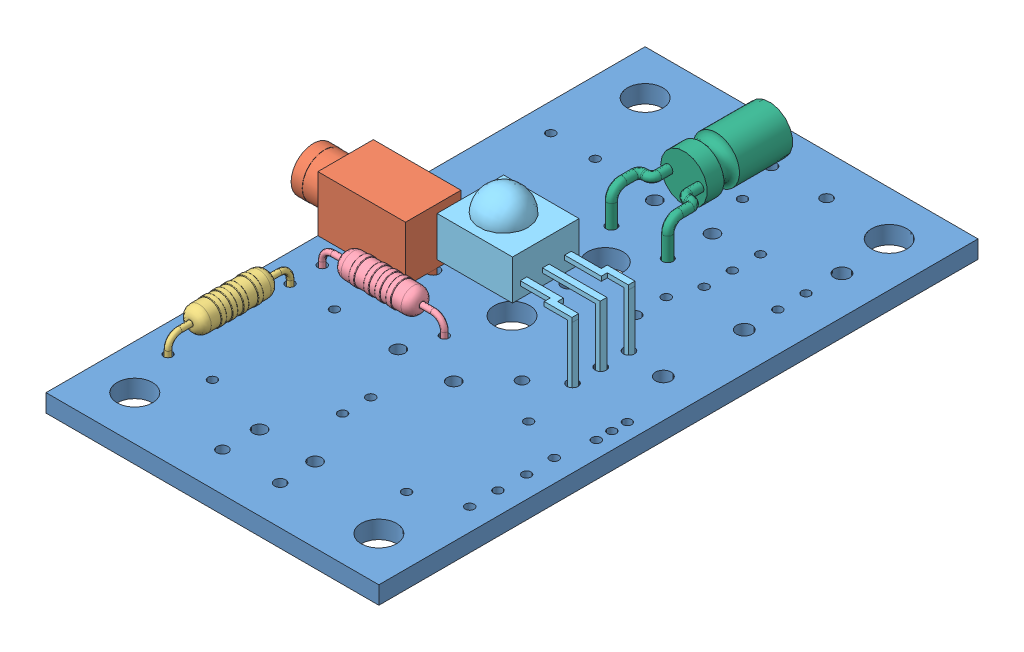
SolidWorks assembly Module récepteur IR 01.SLDASM, configuration Défaut (file format 7000). Lengths in mm.
Overall size (32.91 12.81 54).
6 component instances, 6 part files, 12 mates.
Components (placement in the parent):
- CI BP et DEL-1: CI BP et DEL.SLDPRT [Défaut] at (-14.8869 -1.2382 0) size (30 1.6 54)
- Embase jack 2.5-1: Embase jack 2.5.SLDPRT [Défaut] at (-14.8868 0.3618 -27.0002) size (10.81 8.01 5)
- Résistance 470 ohm pas 11-1: Résistance 470 ohm pas 11.SLDPRT [Défaut] at (-12.3875 1.7618 -13.9988) x (0 0 1) z (-1 0 0) size (11.5 4.15 2.3)
- Résistance 3,9 K pas 11-1: Résistance 3,9 K pas 11.SLDPRT [Défaut] at (-6.8868 1.7618 -22.4003) size (11.5 4.15 2.3)
- Capteur IR-1: Capteur IR.SLDPRT [Défaut] at (3.1501 5.5618 -27.0084) x (0 0 -1) z (1 0 0) size (6 11.4 12)
- Capa 50V 4.7F 2.54 plié-1: Capa 50V 4.7F 2.54 plié.SLDPRT [Default] at (0.1143 3.3618 -14.9824) x (0 1 0) z (-1 0 0) size (6.7 12.1 5.88)
Mates (geometry in assembly coordinates):
- Coïncidente1: coincident anti-aligned: axis of CI BP et DEL-1 through (-11.3868 0.3618 -27.0002) axis (0 -1 0); axis of Embase jack 2.5-1 through (-11.3868 -1.6382 -27.0002) axis (0 1 0)
- Coïncidente2: coincident aligned: plane of CI BP et DEL-1 through (-14.8869 0.3618 0) normal (-1 0 0); plane of Embase jack 2.5-1 through (-14.8868 5.3618 -29.5002) normal (-1 0 0)
- Coïncidente3: coincident anti-aligned: plane of CI BP et DEL-1 through (-14.8869 0.3618 -54) normal (0 1 0); plane of Embase jack 2.5-1 through (-14.8868 0.3618 -24.5002) normal (0 -1 0)
- Coïncidente4: coincident aligned: axis of CI BP et DEL-1 through (-12.3875 0.3618 -22.4003) axis (0 -1 0); axis of Résistance 3,9 K pas 11-1 through (-12.3868 0.7618 -22.4003) axis (0 -1 0)
- Coïncidente5: coincident aligned: axis of CI BP et DEL-1 through (-1.3868 0.3618 -22.4003) axis (0 -1 0); axis of Résistance 3,9 K pas 11-1 through (-1.3868 0.7618 -22.4003) axis (0 -1 0)
- Coïncidente6: coincident aligned: axis of CI BP et DEL-1 through (-12.3875 0.3618 -8.4988) axis (0 -1 0); axis of Résistance 470 ohm pas 11-1 through (-12.3875 0.7618 -8.4988) axis (0 -1 0)
- Coïncidente7: coincident aligned: axis of CI BP et DEL-1 through (-12.3875 0.3618 -19.4996) axis (0 -1 0); axis of Résistance 470 ohm pas 11-1 through (-12.3875 0.7618 -19.4988) axis (0 -1 0)
- Coïncidente8: coincident aligned: plane of CI BP et DEL-1 through (-14.8869 -1.2382 -54) normal (0 -1 0); plane of Résistance 3,9 K pas 11-1 through (-12.3868 -1.2382 -22.4003) normal (0 -1 0)
- Coïncidente9: coincident aligned: plane of CI BP et DEL-1 through (-14.8869 -1.2382 -54) normal (0 -1 0); plane of Résistance 470 ohm pas 11-1 through (-12.3875 -1.2382 -19.4988) normal (0 -1 0)
- Coïncidente16: coincident aligned: axis of CI BP et DEL-1 through (-2.4257 0.3618 -38.4988) axis (0 -1 0); axis of Capa 50V 4.7F 2.54 plié-1 through (-2.4257 2.3618 -38.4988) axis (0 -1 0)
- Coïncidente17: coincident aligned: axis of CI BP et DEL-1 through (2.6543 0.3618 -38.4988) axis (0 -1 0); axis of Capa 50V 4.7F 2.54 plié-1 through (2.6543 2.3618 -38.4988) axis (0 -1 0)
- Coïncidente18: coincident aligned: plane of CI BP et DEL-1 through (-14.8869 -1.2382 -54) normal (0 -1 0); plane of Capa 50V 4.7F 2.54 plié-1 through (-2.4257 -1.2382 -38.4988) normal (0 -1 0)
